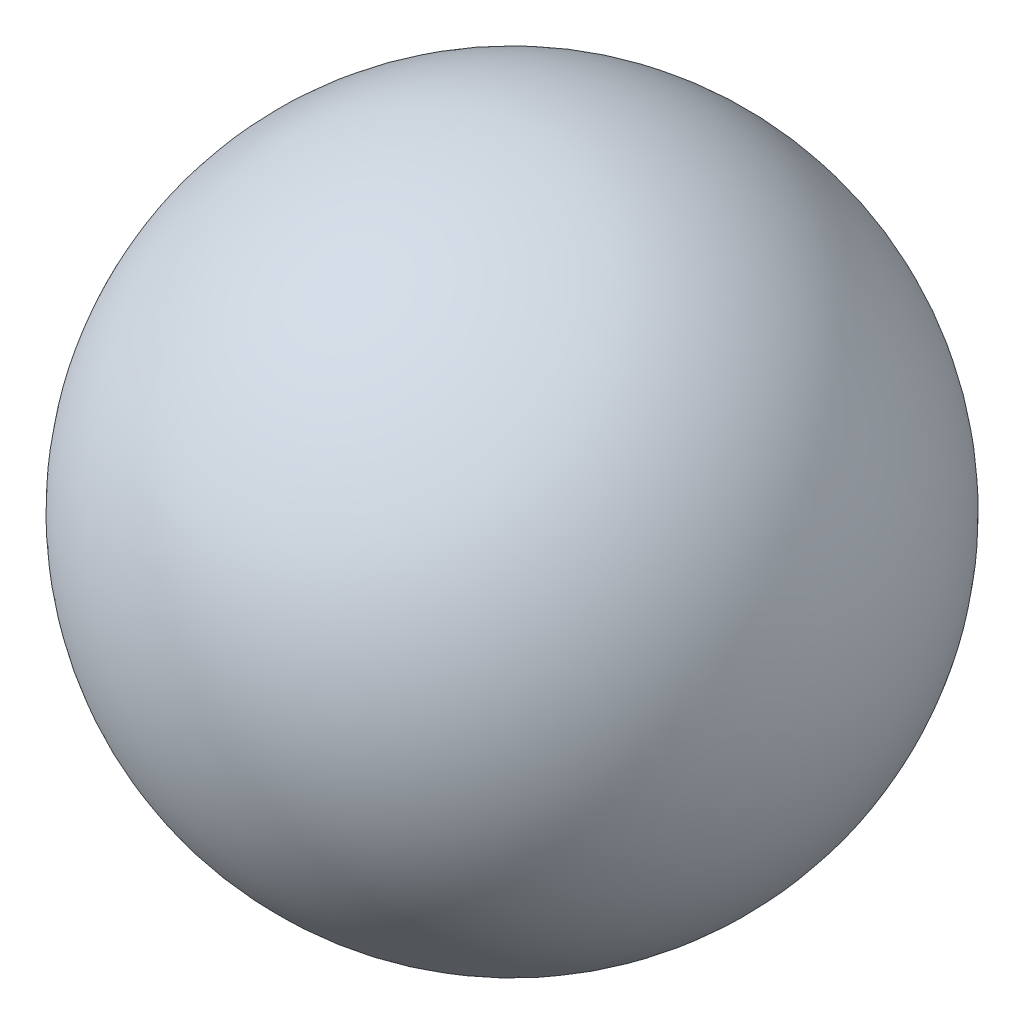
ISO-10303-21;
HEADER;
FILE_DESCRIPTION(('STEP AP214'),'2;1');
FILE_NAME('part.step','',(''),(''),'','','');
FILE_SCHEMA(('AUTOMOTIVE_DESIGN { 1 0 10303 214 1 1 1 1 }'));
ENDSEC;
DATA;
#1=APPLICATION_CONTEXT('core data for automotive mechanical design processes');
#2=APPLICATION_PROTOCOL_DEFINITION('international standard','automotive_design',2000,#1);
#3=PRODUCT_CONTEXT('',#1,'mechanical');
#4=PRODUCT('Part','Part','',(#3));
#5=PRODUCT_RELATED_PRODUCT_CATEGORY('part','',(#4));
#6=PRODUCT_DEFINITION_FORMATION('','',#4);
#7=PRODUCT_DEFINITION_CONTEXT('part definition',#1,'design');
#8=PRODUCT_DEFINITION('design','',#6,#7);
#9=PRODUCT_DEFINITION_SHAPE('','',#8);
#10=(LENGTH_UNIT() NAMED_UNIT(*) SI_UNIT(.MILLI.,.METRE.));
#11=(NAMED_UNIT(*) PLANE_ANGLE_UNIT() SI_UNIT($,.RADIAN.));
#12=(NAMED_UNIT(*) SI_UNIT($,.STERADIAN.) SOLID_ANGLE_UNIT());
#13=UNCERTAINTY_MEASURE_WITH_UNIT(LENGTH_MEASURE(1.E-05),#10,'distance_accuracy_value','');
#14=(GEOMETRIC_REPRESENTATION_CONTEXT(3) GLOBAL_UNCERTAINTY_ASSIGNED_CONTEXT((#13)) GLOBAL_UNIT_ASSIGNED_CONTEXT((#10,
#11,#12)) REPRESENTATION_CONTEXT('',''));
#15=CARTESIAN_POINT('',(0.,0.,0.));
#16=DIRECTION('',(0.,0.,1.));
#17=DIRECTION('',(1.,0.,0.));
#18=AXIS2_PLACEMENT_3D('',#15,#16,#17);
#19=CARTESIAN_POINT('',(5.,13.75,0.));
#20=DIRECTION('',(1.,0.,0.));
#21=DIRECTION('',(0.,-1.,0.));
#22=AXIS2_PLACEMENT_3D('',#19,#20,#21);
#23=SPHERICAL_SURFACE('',#22,2.778);
#24=CARTESIAN_POINT('',(7.778,13.75,0.));
#25=VERTEX_POINT('',#24);
#26=VERTEX_LOOP('',#25);
#27=FACE_BOUND('',#26,.T.);
#28=ADVANCED_FACE('F13',(#27),#23,.T.);
#29=CLOSED_SHELL('',(#28));
#30=MANIFOLD_SOLID_BREP('B1',#29);
#31=ADVANCED_BREP_SHAPE_REPRESENTATION('',(#18,#30),#14);
#32=SHAPE_DEFINITION_REPRESENTATION(#9,#31);
ENDSEC;
END-ISO-10303-21;
